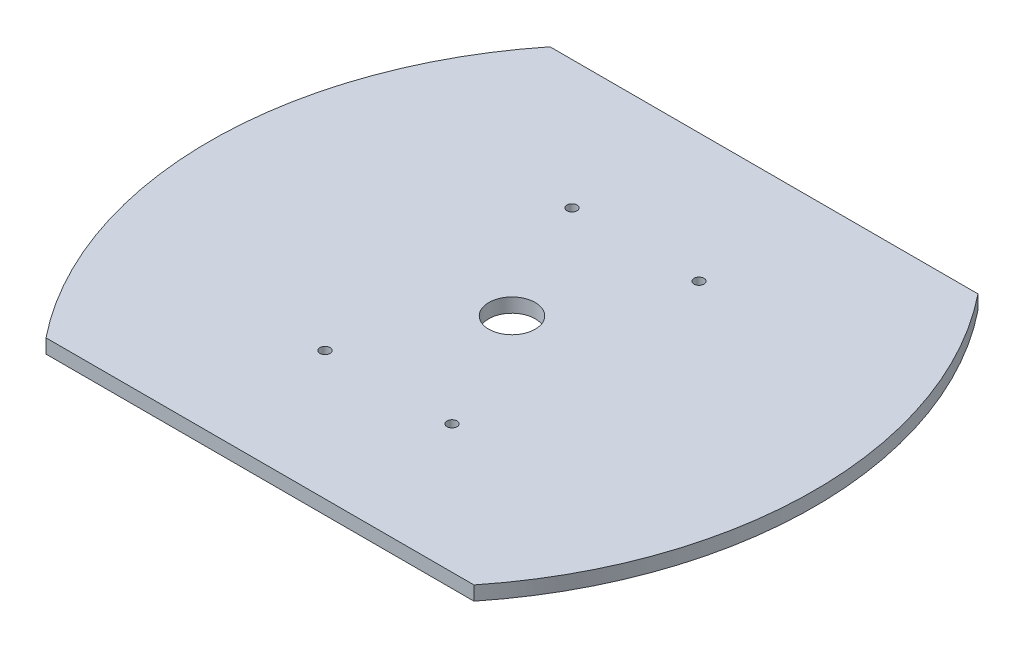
ISO-10303-21;
HEADER;
FILE_DESCRIPTION(('STEP AP214'),'2;1');
FILE_NAME('part.step','',(''),(''),'','','');
FILE_SCHEMA(('AUTOMOTIVE_DESIGN { 1 0 10303 214 1 1 1 1 }'));
ENDSEC;
DATA;
#1=APPLICATION_CONTEXT('core data for automotive mechanical design processes');
#2=APPLICATION_PROTOCOL_DEFINITION('international standard','automotive_design',2000,#1);
#3=PRODUCT_CONTEXT('',#1,'mechanical');
#4=PRODUCT('Part','Part','',(#3));
#5=PRODUCT_RELATED_PRODUCT_CATEGORY('part','',(#4));
#6=PRODUCT_DEFINITION_FORMATION('','',#4);
#7=PRODUCT_DEFINITION_CONTEXT('part definition',#1,'design');
#8=PRODUCT_DEFINITION('design','',#6,#7);
#9=PRODUCT_DEFINITION_SHAPE('','',#8);
#10=(LENGTH_UNIT() NAMED_UNIT(*) SI_UNIT(.MILLI.,.METRE.));
#11=(NAMED_UNIT(*) PLANE_ANGLE_UNIT() SI_UNIT($,.RADIAN.));
#12=(NAMED_UNIT(*) SI_UNIT($,.STERADIAN.) SOLID_ANGLE_UNIT());
#13=UNCERTAINTY_MEASURE_WITH_UNIT(LENGTH_MEASURE(1.E-05),#10,'distance_accuracy_value','');
#14=(GEOMETRIC_REPRESENTATION_CONTEXT(3) GLOBAL_UNCERTAINTY_ASSIGNED_CONTEXT((#13)) GLOBAL_UNIT_ASSIGNED_CONTEXT((#10,
#11,#12)) REPRESENTATION_CONTEXT('',''));
#15=CARTESIAN_POINT('',(0.,0.,0.));
#16=DIRECTION('',(0.,0.,1.));
#17=DIRECTION('',(1.,0.,0.));
#18=AXIS2_PLACEMENT_3D('',#15,#16,#17);
#19=CARTESIAN_POINT('',(-50.,3.5,0.));
#20=DIRECTION('',(0.,-1.,0.));
#21=DIRECTION('',(0.,0.,-1.));
#22=AXIS2_PLACEMENT_3D('',#19,#20,#21);
#23=CYLINDRICAL_SURFACE('',#22,200.);
#24=CARTESIAN_POINT('',(-50.,-3.5,0.));
#25=DIRECTION('',(0.,1.,0.));
#26=DIRECTION('',(0.,0.,-1.));
#27=AXIS2_PLACEMENT_3D('',#24,#25,#26);
#28=CIRCLE('',#27,200.);
#29=CARTESIAN_POINT('',(106.12494995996,-3.5,125.));
#30=VERTEX_POINT('',#29);
#31=CARTESIAN_POINT('',(106.12494995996,-3.5,-125.));
#32=VERTEX_POINT('',#31);
#33=EDGE_CURVE('E100',#30,#32,#28,.T.);
#34=ORIENTED_EDGE('',*,*,#33,.T.);
#35=DIRECTION('',(0.,-1.,0.));
#36=VECTOR('',#35,1.);
#37=CARTESIAN_POINT('',(106.12494995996,3.5,-125.));
#38=LINE('',#37,#36);
#39=CARTESIAN_POINT('',(106.12494995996,3.5,-125.));
#40=VERTEX_POINT('',#39);
#41=EDGE_CURVE('E11',#40,#32,#38,.T.);
#42=ORIENTED_EDGE('',*,*,#41,.F.);
#43=CARTESIAN_POINT('',(-50.,3.5,0.));
#44=DIRECTION('',(0.,1.,0.));
#45=DIRECTION('',(0.,0.,-1.));
#46=AXIS2_PLACEMENT_3D('',#43,#44,#45);
#47=CIRCLE('',#46,200.);
#48=CARTESIAN_POINT('',(106.12494995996,3.5,125.));
#49=VERTEX_POINT('',#48);
#50=EDGE_CURVE('E87',#49,#40,#47,.T.);
#51=ORIENTED_EDGE('',*,*,#50,.F.);
#52=DIRECTION('',(0.,-1.,0.));
#53=VECTOR('',#52,1.);
#54=CARTESIAN_POINT('',(106.12494995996,3.5,125.));
#55=LINE('',#54,#53);
#56=EDGE_CURVE('E96',#49,#30,#55,.T.);
#57=ORIENTED_EDGE('',*,*,#56,.T.);
#58=EDGE_LOOP('',(#34,#42,#51,#57));
#59=FACE_BOUND('',#58,.T.);
#60=ADVANCED_FACE('F34',(#59),#23,.T.);
#61=CARTESIAN_POINT('',(-106.12494995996,3.5,-125.));
#62=DIRECTION('',(0.,0.,1.));
#63=DIRECTION('',(1.,0.,0.));
#64=AXIS2_PLACEMENT_3D('',#61,#62,#63);
#65=PLANE('',#64);
#66=DIRECTION('',(-1.,0.,0.));
#67=VECTOR('',#66,1.);
#68=CARTESIAN_POINT('',(-106.12494995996,-3.5,-125.));
#69=LINE('',#68,#67);
#70=CARTESIAN_POINT('',(-106.12494995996,-3.5,-125.));
#71=VERTEX_POINT('',#70);
#72=EDGE_CURVE('E91',#32,#71,#69,.T.);
#73=ORIENTED_EDGE('',*,*,#72,.T.);
#74=DIRECTION('',(0.,-1.,0.));
#75=VECTOR('',#74,1.);
#76=CARTESIAN_POINT('',(-106.12494995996,3.5,-125.));
#77=LINE('',#76,#75);
#78=CARTESIAN_POINT('',(-106.12494995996,3.5,-125.));
#79=VERTEX_POINT('',#78);
#80=EDGE_CURVE('E43',#79,#71,#77,.T.);
#81=ORIENTED_EDGE('',*,*,#80,.F.);
#82=DIRECTION('',(-1.,0.,0.));
#83=VECTOR('',#82,1.);
#84=CARTESIAN_POINT('',(-106.12494995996,3.5,-125.));
#85=LINE('',#84,#83);
#86=EDGE_CURVE('E82',#40,#79,#85,.T.);
#87=ORIENTED_EDGE('',*,*,#86,.F.);
#88=ORIENTED_EDGE('',*,*,#41,.T.);
#89=EDGE_LOOP('',(#73,#81,#87,#88));
#90=FACE_BOUND('',#89,.T.);
#91=ADVANCED_FACE('F90',(#90),#65,.F.);
#92=CARTESIAN_POINT('',(50.,3.5,0.));
#93=DIRECTION('',(0.,-1.,0.));
#94=DIRECTION('',(0.,0.,-1.));
#95=AXIS2_PLACEMENT_3D('',#92,#93,#94);
#96=CYLINDRICAL_SURFACE('',#95,200.);
#97=CARTESIAN_POINT('',(50.,-3.5,0.));
#98=DIRECTION('',(0.,1.,0.));
#99=DIRECTION('',(0.,0.,-1.));
#100=AXIS2_PLACEMENT_3D('',#97,#98,#99);
#101=CIRCLE('',#100,200.);
#102=CARTESIAN_POINT('',(-106.12494995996,-3.5,125.));
#103=VERTEX_POINT('',#102);
#104=EDGE_CURVE('E69',#71,#103,#101,.T.);
#105=ORIENTED_EDGE('',*,*,#104,.T.);
#106=DIRECTION('',(0.,-1.,0.));
#107=VECTOR('',#106,1.);
#108=CARTESIAN_POINT('',(-106.12494995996,3.5,125.));
#109=LINE('',#108,#107);
#110=CARTESIAN_POINT('',(-106.12494995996,3.5,125.));
#111=VERTEX_POINT('',#110);
#112=EDGE_CURVE('E92',#111,#103,#109,.T.);
#113=ORIENTED_EDGE('',*,*,#112,.F.);
#114=CARTESIAN_POINT('',(50.,3.5,0.));
#115=DIRECTION('',(0.,1.,0.));
#116=DIRECTION('',(0.,0.,-1.));
#117=AXIS2_PLACEMENT_3D('',#114,#115,#116);
#118=CIRCLE('',#117,200.);
#119=EDGE_CURVE('E85',#79,#111,#118,.T.);
#120=ORIENTED_EDGE('',*,*,#119,.F.);
#121=ORIENTED_EDGE('',*,*,#80,.T.);
#122=EDGE_LOOP('',(#105,#113,#120,#121));
#123=FACE_BOUND('',#122,.T.);
#124=ADVANCED_FACE('F94',(#123),#96,.T.);
#125=CARTESIAN_POINT('',(-106.12494995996,3.5,125.));
#126=DIRECTION('',(0.,0.,-1.));
#127=DIRECTION('',(-1.,0.,0.));
#128=AXIS2_PLACEMENT_3D('',#125,#126,#127);
#129=PLANE('',#128);
#130=DIRECTION('',(1.,0.,0.));
#131=VECTOR('',#130,1.);
#132=CARTESIAN_POINT('',(-106.12494995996,-3.5,125.));
#133=LINE('',#132,#131);
#134=EDGE_CURVE('E75',#103,#30,#133,.T.);
#135=ORIENTED_EDGE('',*,*,#134,.T.);
#136=ORIENTED_EDGE('',*,*,#56,.F.);
#137=DIRECTION('',(1.,0.,0.));
#138=VECTOR('',#137,1.);
#139=CARTESIAN_POINT('',(-106.12494995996,3.5,125.));
#140=LINE('',#139,#138);
#141=EDGE_CURVE('E52',#111,#49,#140,.T.);
#142=ORIENTED_EDGE('',*,*,#141,.F.);
#143=ORIENTED_EDGE('',*,*,#112,.T.);
#144=EDGE_LOOP('',(#135,#136,#142,#143));
#145=FACE_BOUND('',#144,.T.);
#146=ADVANCED_FACE('F142',(#145),#129,.F.);
#147=CARTESIAN_POINT('',(-50.,3.5,0.));
#148=DIRECTION('',(0.,-1.,0.));
#149=DIRECTION('',(0.,0.,-1.));
#150=AXIS2_PLACEMENT_3D('',#147,#148,#149);
#151=PLANE('',#150);
#152=CARTESIAN_POINT('',(-31.5,3.5,61.25));
#153=DIRECTION('',(0.,1.,0.));
#154=DIRECTION('',(0.,0.,1.));
#155=AXIS2_PLACEMENT_3D('',#152,#153,#154);
#156=CIRCLE('',#155,2.5);
#157=CARTESIAN_POINT('',(-31.5,3.5,63.75));
#158=VERTEX_POINT('',#157);
#159=EDGE_CURVE('E234',#158,#158,#156,.T.);
#160=ORIENTED_EDGE('',*,*,#159,.F.);
#161=EDGE_LOOP('',(#160));
#162=FACE_BOUND('',#161,.T.);
#163=CARTESIAN_POINT('',(31.5,3.5,61.25));
#164=DIRECTION('',(0.,1.,0.));
#165=DIRECTION('',(0.,0.,1.));
#166=AXIS2_PLACEMENT_3D('',#163,#164,#165);
#167=CIRCLE('',#166,2.5);
#168=CARTESIAN_POINT('',(31.5,3.5,63.75));
#169=VERTEX_POINT('',#168);
#170=EDGE_CURVE('E231',#169,#169,#167,.T.);
#171=ORIENTED_EDGE('',*,*,#170,.F.);
#172=EDGE_LOOP('',(#171));
#173=FACE_BOUND('',#172,.T.);
#174=CARTESIAN_POINT('',(31.5,3.5,-61.25));
#175=DIRECTION('',(0.,1.,0.));
#176=DIRECTION('',(0.,0.,1.));
#177=AXIS2_PLACEMENT_3D('',#174,#175,#176);
#178=CIRCLE('',#177,2.5);
#179=CARTESIAN_POINT('',(31.5,3.5,-58.75));
#180=VERTEX_POINT('',#179);
#181=EDGE_CURVE('E233',#180,#180,#178,.T.);
#182=ORIENTED_EDGE('',*,*,#181,.F.);
#183=EDGE_LOOP('',(#182));
#184=FACE_BOUND('',#183,.T.);
#185=CARTESIAN_POINT('',(-31.5,3.5,-61.25));
#186=DIRECTION('',(0.,1.,0.));
#187=DIRECTION('',(0.,0.,1.));
#188=AXIS2_PLACEMENT_3D('',#185,#186,#187);
#189=CIRCLE('',#188,2.5);
#190=CARTESIAN_POINT('',(-31.5,3.5,-58.75));
#191=VERTEX_POINT('',#190);
#192=EDGE_CURVE('E116',#191,#191,#189,.T.);
#193=ORIENTED_EDGE('',*,*,#192,.F.);
#194=EDGE_LOOP('',(#193));
#195=FACE_BOUND('',#194,.T.);
#196=CARTESIAN_POINT('',(0.,3.5,0.));
#197=DIRECTION('',(0.,-1.,0.));
#198=DIRECTION('',(0.,0.,-1.));
#199=AXIS2_PLACEMENT_3D('',#196,#197,#198);
#200=CIRCLE('',#199,11.5);
#201=CARTESIAN_POINT('',(0.,3.5,-11.5));
#202=VERTEX_POINT('',#201);
#203=EDGE_CURVE('E103',#202,#202,#200,.T.);
#204=ORIENTED_EDGE('',*,*,#203,.T.);
#205=EDGE_LOOP('',(#204));
#206=FACE_BOUND('',#205,.T.);
#207=ORIENTED_EDGE('',*,*,#50,.T.);
#208=ORIENTED_EDGE('',*,*,#86,.T.);
#209=ORIENTED_EDGE('',*,*,#119,.T.);
#210=ORIENTED_EDGE('',*,*,#141,.T.);
#211=EDGE_LOOP('',(#207,#208,#209,#210));
#212=FACE_BOUND('',#211,.T.);
#213=ADVANCED_FACE('F83',(#162,#173,#184,#195,#206,#212),#151,.F.);
#214=CARTESIAN_POINT('',(-50.,-3.5,0.));
#215=DIRECTION('',(0.,-1.,0.));
#216=DIRECTION('',(0.,0.,-1.));
#217=AXIS2_PLACEMENT_3D('',#214,#215,#216);
#218=PLANE('',#217);
#219=CARTESIAN_POINT('',(-31.5,-3.5,61.25));
#220=DIRECTION('',(0.,-1.,0.));
#221=DIRECTION('',(0.,0.,-1.));
#222=AXIS2_PLACEMENT_3D('',#219,#220,#221);
#223=CIRCLE('',#222,2.5);
#224=CARTESIAN_POINT('',(-31.5,-3.5,58.75));
#225=VERTEX_POINT('',#224);
#226=EDGE_CURVE('E37',#225,#225,#223,.T.);
#227=ORIENTED_EDGE('',*,*,#226,.F.);
#228=EDGE_LOOP('',(#227));
#229=FACE_BOUND('',#228,.T.);
#230=CARTESIAN_POINT('',(31.5,-3.5,61.25));
#231=DIRECTION('',(0.,-1.,0.));
#232=DIRECTION('',(0.,0.,-1.));
#233=AXIS2_PLACEMENT_3D('',#230,#231,#232);
#234=CIRCLE('',#233,2.5);
#235=CARTESIAN_POINT('',(31.5,-3.5,58.75));
#236=VERTEX_POINT('',#235);
#237=EDGE_CURVE('E118',#236,#236,#234,.T.);
#238=ORIENTED_EDGE('',*,*,#237,.F.);
#239=EDGE_LOOP('',(#238));
#240=FACE_BOUND('',#239,.T.);
#241=CARTESIAN_POINT('',(31.5,-3.5,-61.25));
#242=DIRECTION('',(0.,-1.,0.));
#243=DIRECTION('',(0.,0.,-1.));
#244=AXIS2_PLACEMENT_3D('',#241,#242,#243);
#245=CIRCLE('',#244,2.5);
#246=CARTESIAN_POINT('',(31.5,-3.5,-63.75));
#247=VERTEX_POINT('',#246);
#248=EDGE_CURVE('E115',#247,#247,#245,.T.);
#249=ORIENTED_EDGE('',*,*,#248,.F.);
#250=EDGE_LOOP('',(#249));
#251=FACE_BOUND('',#250,.T.);
#252=CARTESIAN_POINT('',(-31.5,-3.5,-61.25));
#253=DIRECTION('',(0.,-1.,0.));
#254=DIRECTION('',(0.,0.,-1.));
#255=AXIS2_PLACEMENT_3D('',#252,#253,#254);
#256=CIRCLE('',#255,2.5);
#257=CARTESIAN_POINT('',(-31.5,-3.5,-63.75));
#258=VERTEX_POINT('',#257);
#259=EDGE_CURVE('E112',#258,#258,#256,.T.);
#260=ORIENTED_EDGE('',*,*,#259,.F.);
#261=EDGE_LOOP('',(#260));
#262=FACE_BOUND('',#261,.T.);
#263=CARTESIAN_POINT('',(0.,-3.5,0.));
#264=DIRECTION('',(0.,-1.,0.));
#265=DIRECTION('',(0.,0.,-1.));
#266=AXIS2_PLACEMENT_3D('',#263,#264,#265);
#267=CIRCLE('',#266,11.5);
#268=CARTESIAN_POINT('',(0.,-3.5,-11.5));
#269=VERTEX_POINT('',#268);
#270=EDGE_CURVE('E109',#269,#269,#267,.T.);
#271=ORIENTED_EDGE('',*,*,#270,.F.);
#272=EDGE_LOOP('',(#271));
#273=FACE_BOUND('',#272,.T.);
#274=ORIENTED_EDGE('',*,*,#33,.F.);
#275=ORIENTED_EDGE('',*,*,#134,.F.);
#276=ORIENTED_EDGE('',*,*,#104,.F.);
#277=ORIENTED_EDGE('',*,*,#72,.F.);
#278=EDGE_LOOP('',(#274,#275,#276,#277));
#279=FACE_BOUND('',#278,.T.);
#280=ADVANCED_FACE('F128',(#229,#240,#251,#262,#273,#279),#218,.T.);
#281=CARTESIAN_POINT('',(0.,-5.,0.));
#282=DIRECTION('',(0.,1.,0.));
#283=DIRECTION('',(0.,0.,1.));
#284=AXIS2_PLACEMENT_3D('',#281,#282,#283);
#285=CYLINDRICAL_SURFACE('',#284,11.5);
#286=ORIENTED_EDGE('',*,*,#270,.T.);
#287=EDGE_LOOP('',(#286));
#288=FACE_BOUND('',#287,.T.);
#289=ORIENTED_EDGE('',*,*,#203,.F.);
#290=EDGE_LOOP('',(#289));
#291=FACE_BOUND('',#290,.T.);
#292=ADVANCED_FACE('F131',(#288,#291),#285,.F.);
#293=CARTESIAN_POINT('',(-31.5,-6.5,-61.25));
#294=DIRECTION('',(0.,1.,0.));
#295=DIRECTION('',(0.,0.,1.));
#296=AXIS2_PLACEMENT_3D('',#293,#294,#295);
#297=CYLINDRICAL_SURFACE('',#296,2.5);
#298=ORIENTED_EDGE('',*,*,#259,.T.);
#299=EDGE_LOOP('',(#298));
#300=FACE_BOUND('',#299,.T.);
#301=ORIENTED_EDGE('',*,*,#192,.T.);
#302=EDGE_LOOP('',(#301));
#303=FACE_BOUND('',#302,.T.);
#304=ADVANCED_FACE('F176',(#300,#303),#297,.F.);
#305=CARTESIAN_POINT('',(31.5,-6.5,-61.25));
#306=DIRECTION('',(0.,1.,0.));
#307=DIRECTION('',(0.,0.,1.));
#308=AXIS2_PLACEMENT_3D('',#305,#306,#307);
#309=CYLINDRICAL_SURFACE('',#308,2.5);
#310=ORIENTED_EDGE('',*,*,#248,.T.);
#311=EDGE_LOOP('',(#310));
#312=FACE_BOUND('',#311,.T.);
#313=ORIENTED_EDGE('',*,*,#181,.T.);
#314=EDGE_LOOP('',(#313));
#315=FACE_BOUND('',#314,.T.);
#316=ADVANCED_FACE('F197',(#312,#315),#309,.F.);
#317=CARTESIAN_POINT('',(31.5,-6.5,61.25));
#318=DIRECTION('',(0.,1.,0.));
#319=DIRECTION('',(0.,0.,1.));
#320=AXIS2_PLACEMENT_3D('',#317,#318,#319);
#321=CYLINDRICAL_SURFACE('',#320,2.5);
#322=ORIENTED_EDGE('',*,*,#237,.T.);
#323=EDGE_LOOP('',(#322));
#324=FACE_BOUND('',#323,.T.);
#325=ORIENTED_EDGE('',*,*,#170,.T.);
#326=EDGE_LOOP('',(#325));
#327=FACE_BOUND('',#326,.T.);
#328=ADVANCED_FACE('F207',(#324,#327),#321,.F.);
#329=CARTESIAN_POINT('',(-31.5,-6.5,61.25));
#330=DIRECTION('',(0.,1.,0.));
#331=DIRECTION('',(0.,0.,1.));
#332=AXIS2_PLACEMENT_3D('',#329,#330,#331);
#333=CYLINDRICAL_SURFACE('',#332,2.5);
#334=ORIENTED_EDGE('',*,*,#226,.T.);
#335=EDGE_LOOP('',(#334));
#336=FACE_BOUND('',#335,.T.);
#337=ORIENTED_EDGE('',*,*,#159,.T.);
#338=EDGE_LOOP('',(#337));
#339=FACE_BOUND('',#338,.T.);
#340=ADVANCED_FACE('F125',(#336,#339),#333,.F.);
#341=CLOSED_SHELL('',(#60,#91,#124,#146,#213,#280,#292,#304,#316,#328,#340));
#342=MANIFOLD_SOLID_BREP('B2',#341);
#343=ADVANCED_BREP_SHAPE_REPRESENTATION('',(#18,#342),#14);
#344=SHAPE_DEFINITION_REPRESENTATION(#9,#343);
ENDSEC;
END-ISO-10303-21;
